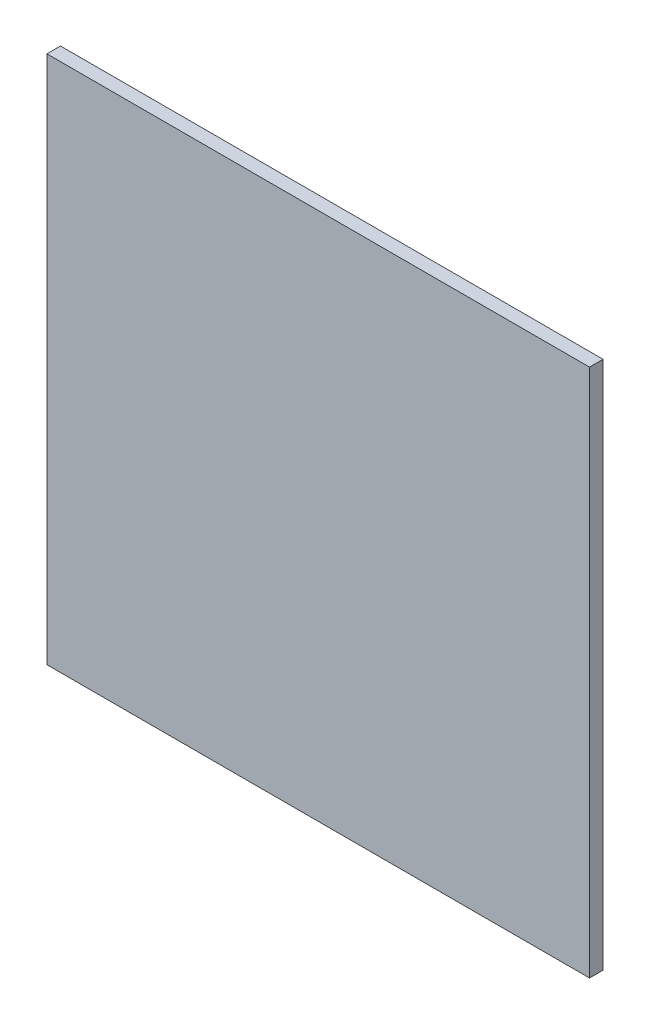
ISO-10303-21;
HEADER;
FILE_DESCRIPTION(('STEP AP214'),'2;1');
FILE_NAME('part.step','',(''),(''),'','','');
FILE_SCHEMA(('AUTOMOTIVE_DESIGN { 1 0 10303 214 1 1 1 1 }'));
ENDSEC;
DATA;
#1=APPLICATION_CONTEXT('core data for automotive mechanical design processes');
#2=APPLICATION_PROTOCOL_DEFINITION('international standard','automotive_design',2000,#1);
#3=PRODUCT_CONTEXT('',#1,'mechanical');
#4=PRODUCT('Part','Part','',(#3));
#5=PRODUCT_RELATED_PRODUCT_CATEGORY('part','',(#4));
#6=PRODUCT_DEFINITION_FORMATION('','',#4);
#7=PRODUCT_DEFINITION_CONTEXT('part definition',#1,'design');
#8=PRODUCT_DEFINITION('design','',#6,#7);
#9=PRODUCT_DEFINITION_SHAPE('','',#8);
#10=(LENGTH_UNIT() NAMED_UNIT(*) SI_UNIT(.MILLI.,.METRE.));
#11=(NAMED_UNIT(*) PLANE_ANGLE_UNIT() SI_UNIT($,.RADIAN.));
#12=(NAMED_UNIT(*) SI_UNIT($,.STERADIAN.) SOLID_ANGLE_UNIT());
#13=UNCERTAINTY_MEASURE_WITH_UNIT(LENGTH_MEASURE(1.E-05),#10,'distance_accuracy_value','');
#14=(GEOMETRIC_REPRESENTATION_CONTEXT(3) GLOBAL_UNCERTAINTY_ASSIGNED_CONTEXT((#13)) GLOBAL_UNIT_ASSIGNED_CONTEXT((#10,
#11,#12)) REPRESENTATION_CONTEXT('',''));
#15=CARTESIAN_POINT('',(0.,0.,0.));
#16=DIRECTION('',(0.,0.,1.));
#17=DIRECTION('',(1.,0.,0.));
#18=AXIS2_PLACEMENT_3D('',#15,#16,#17);
#19=CARTESIAN_POINT('',(300.,292.5,15.));
#20=DIRECTION('',(-1.,0.,0.));
#21=DIRECTION('',(0.,-1.,0.));
#22=AXIS2_PLACEMENT_3D('',#19,#20,#21);
#23=PLANE('',#22);
#24=DIRECTION('',(0.,1.,0.));
#25=VECTOR('',#24,1.);
#26=CARTESIAN_POINT('',(300.,292.5,0.));
#27=LINE('',#26,#25);
#28=CARTESIAN_POINT('',(300.,-292.5,0.));
#29=VERTEX_POINT('',#28);
#30=CARTESIAN_POINT('',(300.,292.5,0.));
#31=VERTEX_POINT('',#30);
#32=EDGE_CURVE('E111',#29,#31,#27,.T.);
#33=ORIENTED_EDGE('',*,*,#32,.T.);
#34=DIRECTION('',(0.,0.,-1.));
#35=VECTOR('',#34,1.);
#36=CARTESIAN_POINT('',(300.,292.5,15.));
#37=LINE('',#36,#35);
#38=CARTESIAN_POINT('',(300.,292.5,15.));
#39=VERTEX_POINT('',#38);
#40=EDGE_CURVE('E11',#39,#31,#37,.T.);
#41=ORIENTED_EDGE('',*,*,#40,.F.);
#42=DIRECTION('',(0.,1.,0.));
#43=VECTOR('',#42,1.);
#44=CARTESIAN_POINT('',(300.,292.5,15.));
#45=LINE('',#44,#43);
#46=CARTESIAN_POINT('',(300.,-292.5,15.));
#47=VERTEX_POINT('',#46);
#48=EDGE_CURVE('E95',#47,#39,#45,.T.);
#49=ORIENTED_EDGE('',*,*,#48,.F.);
#50=DIRECTION('',(0.,0.,-1.));
#51=VECTOR('',#50,1.);
#52=CARTESIAN_POINT('',(300.,-292.5,15.));
#53=LINE('',#52,#51);
#54=EDGE_CURVE('E107',#47,#29,#53,.T.);
#55=ORIENTED_EDGE('',*,*,#54,.T.);
#56=EDGE_LOOP('',(#33,#41,#49,#55));
#57=FACE_BOUND('',#56,.T.);
#58=ADVANCED_FACE('F43',(#57),#23,.F.);
#59=CARTESIAN_POINT('',(-300.,292.5,15.));
#60=DIRECTION('',(0.,-1.,0.));
#61=DIRECTION('',(0.,0.,-1.));
#62=AXIS2_PLACEMENT_3D('',#59,#60,#61);
#63=PLANE('',#62);
#64=DIRECTION('',(-1.,0.,0.));
#65=VECTOR('',#64,1.);
#66=CARTESIAN_POINT('',(-300.,292.5,0.));
#67=LINE('',#66,#65);
#68=CARTESIAN_POINT('',(-300.,292.5,0.));
#69=VERTEX_POINT('',#68);
#70=EDGE_CURVE('E100',#31,#69,#67,.T.);
#71=ORIENTED_EDGE('',*,*,#70,.T.);
#72=DIRECTION('',(0.,0.,-1.));
#73=VECTOR('',#72,1.);
#74=CARTESIAN_POINT('',(-300.,292.5,15.));
#75=LINE('',#74,#73);
#76=CARTESIAN_POINT('',(-300.,292.5,15.));
#77=VERTEX_POINT('',#76);
#78=EDGE_CURVE('E52',#77,#69,#75,.T.);
#79=ORIENTED_EDGE('',*,*,#78,.F.);
#80=DIRECTION('',(-1.,0.,0.));
#81=VECTOR('',#80,1.);
#82=CARTESIAN_POINT('',(-300.,292.5,15.));
#83=LINE('',#82,#81);
#84=EDGE_CURVE('E90',#39,#77,#83,.T.);
#85=ORIENTED_EDGE('',*,*,#84,.F.);
#86=ORIENTED_EDGE('',*,*,#40,.T.);
#87=EDGE_LOOP('',(#71,#79,#85,#86));
#88=FACE_BOUND('',#87,.T.);
#89=ADVANCED_FACE('F99',(#88),#63,.F.);
#90=CARTESIAN_POINT('',(-300.,292.5,15.));
#91=DIRECTION('',(1.,0.,0.));
#92=DIRECTION('',(0.,0.,-1.));
#93=AXIS2_PLACEMENT_3D('',#90,#91,#92);
#94=PLANE('',#93);
#95=DIRECTION('',(0.,-1.,0.));
#96=VECTOR('',#95,1.);
#97=CARTESIAN_POINT('',(-300.,292.5,0.));
#98=LINE('',#97,#96);
#99=CARTESIAN_POINT('',(-300.,-292.5,0.));
#100=VERTEX_POINT('',#99);
#101=EDGE_CURVE('E77',#69,#100,#98,.T.);
#102=ORIENTED_EDGE('',*,*,#101,.T.);
#103=DIRECTION('',(0.,0.,-1.));
#104=VECTOR('',#103,1.);
#105=CARTESIAN_POINT('',(-300.,-292.5,15.));
#106=LINE('',#105,#104);
#107=CARTESIAN_POINT('',(-300.,-292.5,15.));
#108=VERTEX_POINT('',#107);
#109=EDGE_CURVE('E102',#108,#100,#106,.T.);
#110=ORIENTED_EDGE('',*,*,#109,.F.);
#111=DIRECTION('',(0.,-1.,0.));
#112=VECTOR('',#111,1.);
#113=CARTESIAN_POINT('',(-300.,292.5,15.));
#114=LINE('',#113,#112);
#115=EDGE_CURVE('E93',#77,#108,#114,.T.);
#116=ORIENTED_EDGE('',*,*,#115,.F.);
#117=ORIENTED_EDGE('',*,*,#78,.T.);
#118=EDGE_LOOP('',(#102,#110,#116,#117));
#119=FACE_BOUND('',#118,.T.);
#120=ADVANCED_FACE('F103',(#119),#94,.F.);
#121=CARTESIAN_POINT('',(-300.,-292.5,15.));
#122=DIRECTION('',(0.,1.,0.));
#123=DIRECTION('',(0.,0.,1.));
#124=AXIS2_PLACEMENT_3D('',#121,#122,#123);
#125=PLANE('',#124);
#126=DIRECTION('',(1.,0.,0.));
#127=VECTOR('',#126,1.);
#128=CARTESIAN_POINT('',(-300.,-292.5,0.));
#129=LINE('',#128,#127);
#130=EDGE_CURVE('E83',#100,#29,#129,.T.);
#131=ORIENTED_EDGE('',*,*,#130,.T.);
#132=ORIENTED_EDGE('',*,*,#54,.F.);
#133=DIRECTION('',(1.,0.,0.));
#134=VECTOR('',#133,1.);
#135=CARTESIAN_POINT('',(-300.,-292.5,15.));
#136=LINE('',#135,#134);
#137=EDGE_CURVE('E60',#108,#47,#136,.T.);
#138=ORIENTED_EDGE('',*,*,#137,.F.);
#139=ORIENTED_EDGE('',*,*,#109,.T.);
#140=EDGE_LOOP('',(#131,#132,#138,#139));
#141=FACE_BOUND('',#140,.T.);
#142=ADVANCED_FACE('F124',(#141),#125,.F.);
#143=CARTESIAN_POINT('',(0.,0.,15.));
#144=DIRECTION('',(0.,0.,1.));
#145=DIRECTION('',(1.,0.,0.));
#146=AXIS2_PLACEMENT_3D('',#143,#144,#145);
#147=PLANE('',#146);
#148=ORIENTED_EDGE('',*,*,#48,.T.);
#149=ORIENTED_EDGE('',*,*,#84,.T.);
#150=ORIENTED_EDGE('',*,*,#115,.T.);
#151=ORIENTED_EDGE('',*,*,#137,.T.);
#152=EDGE_LOOP('',(#148,#149,#150,#151));
#153=FACE_BOUND('',#152,.T.);
#154=ADVANCED_FACE('F91',(#153),#147,.T.);
#155=CARTESIAN_POINT('',(0.,0.,0.));
#156=DIRECTION('',(0.,0.,1.));
#157=DIRECTION('',(1.,0.,0.));
#158=AXIS2_PLACEMENT_3D('',#155,#156,#157);
#159=PLANE('',#158);
#160=ORIENTED_EDGE('',*,*,#32,.F.);
#161=ORIENTED_EDGE('',*,*,#130,.F.);
#162=ORIENTED_EDGE('',*,*,#101,.F.);
#163=ORIENTED_EDGE('',*,*,#70,.F.);
#164=EDGE_LOOP('',(#160,#161,#162,#163));
#165=FACE_BOUND('',#164,.T.);
#166=ADVANCED_FACE('F127',(#165),#159,.F.);
#167=CLOSED_SHELL('',(#58,#89,#120,#142,#154,#166));
#168=MANIFOLD_SOLID_BREP('B2',#167);
#169=ADVANCED_BREP_SHAPE_REPRESENTATION('',(#18,#168),#14);
#170=SHAPE_DEFINITION_REPRESENTATION(#9,#169);
ENDSEC;
END-ISO-10303-21;
